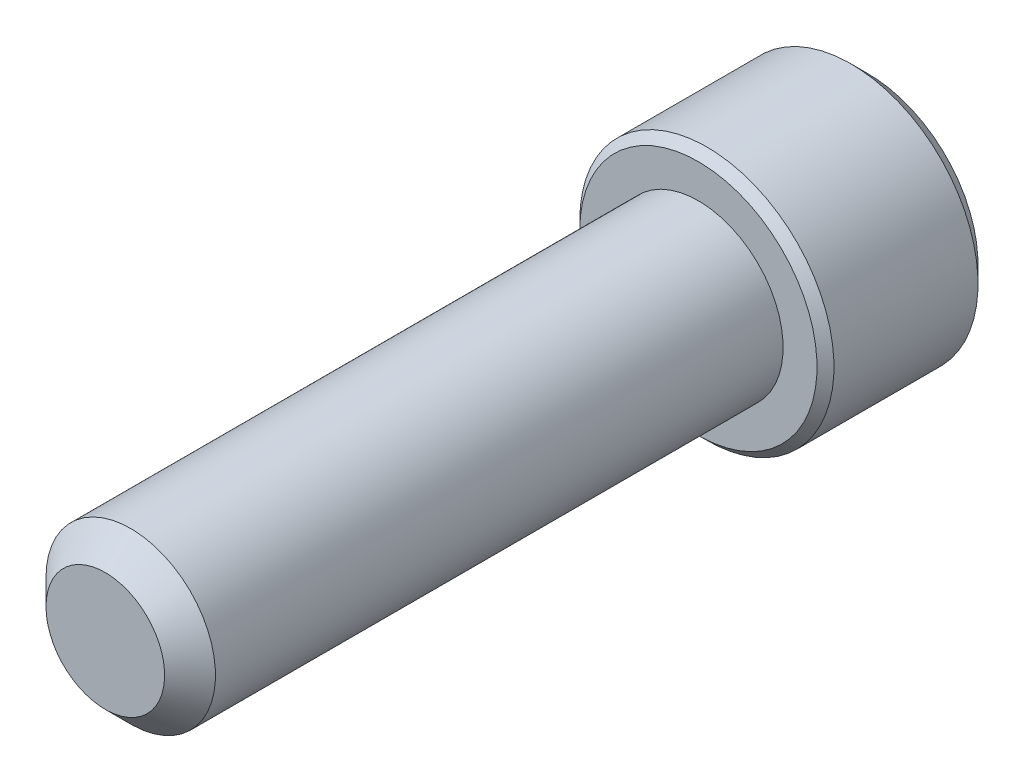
from build123d import *

# Parameters (mm, degrees)
SKETCH1_R          = 3.175
EXTRUDE1_DEPTH     = 22.225
CHAMFER3_SIZE      = 0.9525
SKETCH6_R          = 4.7625
EXTRUDE2_DEPTH     = 6.35
CUT_EXTRUDE1_DEPTH = 3.571875
SKETCH8_R          = 2.749630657
CUT_EXTRUDE2_DEPTH = 0.635
CUT_EXTRUDE2_DRAFT = -45
CHAMFER1_SIZE      = 0.635
CHAMFER2_SIZE      = 0.3175


with BuildPart() as part:
    # Sketch1 → Extrude1 (new body)
    with BuildSketch(Plane.XY):
        Circle(SKETCH1_R)
    extrude(amount=-EXTRUDE1_DEPTH)

    # Chamfer3
    chamfer3_edges = [part.edges().sort_by_distance(p)[0] for p in [
        (-3.175, 0, 0),
    ]]
    chamfer(chamfer3_edges, length=CHAMFER3_SIZE)

    # Sketch6 → Extrude2 (add)
    with BuildSketch(Plane(origin=(0, 0, -22.225), x_dir=(-1, 0, 0), z_dir=(0, 0, -1))):
        Circle(SKETCH6_R)
    extrude(amount=EXTRUDE2_DEPTH)

    # Sketch7 → Cut-Extrude1 (cut)
    with BuildSketch(Plane(origin=(0, 0, -28.575), x_dir=(-1, 0, 0), z_dir=(0, 0, -1))):
        Polygon((0, 2.749630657), (-2.38125, 1.374815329), (-2.38125, -1.374815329), (0, -2.749630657), (2.38125, -1.374815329), (2.38125, 1.374815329), align=None)
    extrude(amount=-CUT_EXTRUDE1_DEPTH, mode=Mode.SUBTRACT)


with BuildPart() as cut_extrude2_tool:
    # Sketch8 → Cut-Extrude2 (with draft: the straight prism first)
    with BuildSketch(Plane(origin=(0, 0, -28.575), x_dir=(-1, 0, 0), z_dir=(0, 0, -1))):
        Circle(SKETCH8_R)
    extrude(amount=-CUT_EXTRUDE2_DEPTH)
    # Cut-Extrude2: the draft: its side faces are tilted about the plane it starts from
    cut_extrude2_sides = [cut_extrude2_tool.faces().sort_by_distance(p)[0] for p in [
        (2.749630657, 0, -28.2575),
    ]]
    draft(cut_extrude2_sides, Plane(origin=(0, 0, -28.575), x_dir=(-1, 0, 0), z_dir=(0, 0, -1)), CUT_EXTRUDE2_DRAFT)


with BuildPart() as part_1:
    add(part.part)

    # Cut-Extrude2: cut by cut_extrude2_tool
    add(cut_extrude2_tool.part, mode=Mode.SUBTRACT)

    # Chamfer1
    chamfer1_edges = [part_1.edges().sort_by_distance(p)[0] for p in [
        (4.7625, 0, -28.575),
    ]]
    chamfer(chamfer1_edges, length=CHAMFER1_SIZE)

    # Chamfer2
    chamfer2_edges = [part_1.edges().sort_by_distance(p)[0] for p in [
        (4.7625, 0, -22.225),
    ]]
    chamfer(chamfer2_edges, length=CHAMFER2_SIZE)


solid = part_1.part
